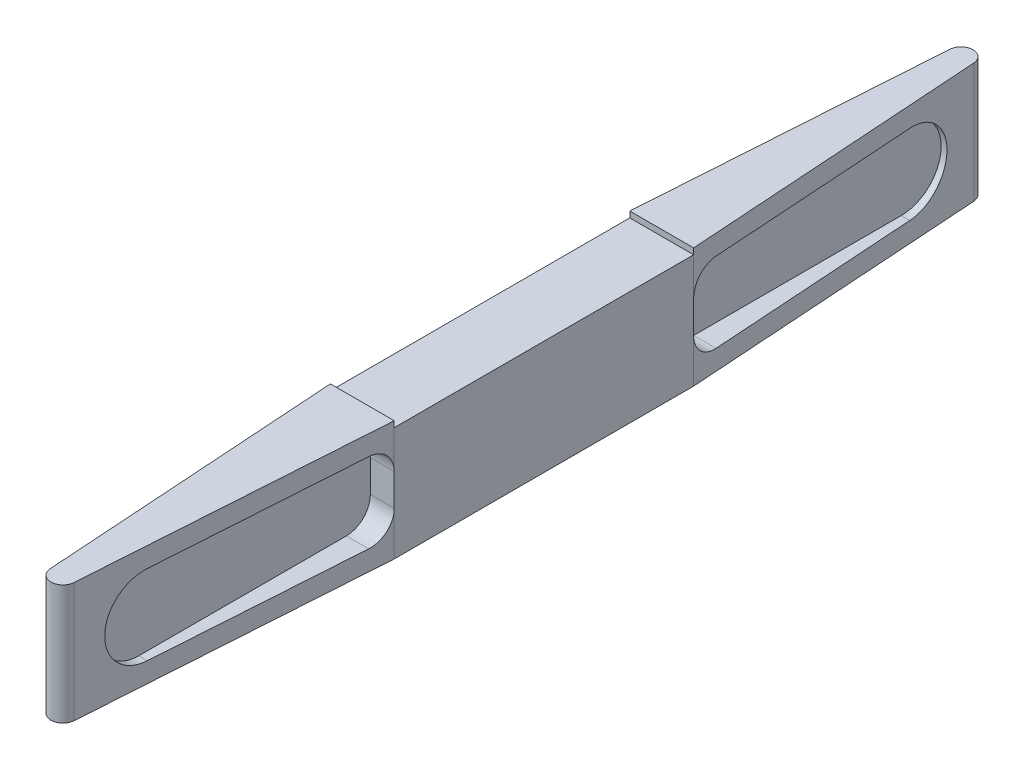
ISO-10303-21;
HEADER;
FILE_DESCRIPTION(('STEP AP214'),'2;1');
FILE_NAME('part.step','',(''),(''),'','','');
FILE_SCHEMA(('AUTOMOTIVE_DESIGN { 1 0 10303 214 1 1 1 1 }'));
ENDSEC;
DATA;
#1=APPLICATION_CONTEXT('core data for automotive mechanical design processes');
#2=APPLICATION_PROTOCOL_DEFINITION('international standard','automotive_design',2000,#1);
#3=PRODUCT_CONTEXT('',#1,'mechanical');
#4=PRODUCT('Part','Part','',(#3));
#5=PRODUCT_RELATED_PRODUCT_CATEGORY('part','',(#4));
#6=PRODUCT_DEFINITION_FORMATION('','',#4);
#7=PRODUCT_DEFINITION_CONTEXT('part definition',#1,'design');
#8=PRODUCT_DEFINITION('design','',#6,#7);
#9=PRODUCT_DEFINITION_SHAPE('','',#8);
#10=(LENGTH_UNIT() NAMED_UNIT(*) SI_UNIT(.MILLI.,.METRE.));
#11=(NAMED_UNIT(*) PLANE_ANGLE_UNIT() SI_UNIT($,.RADIAN.));
#12=(NAMED_UNIT(*) SI_UNIT($,.STERADIAN.) SOLID_ANGLE_UNIT());
#13=UNCERTAINTY_MEASURE_WITH_UNIT(LENGTH_MEASURE(1.E-05),#10,'distance_accuracy_value','');
#14=(GEOMETRIC_REPRESENTATION_CONTEXT(3) GLOBAL_UNCERTAINTY_ASSIGNED_CONTEXT((#13)) GLOBAL_UNIT_ASSIGNED_CONTEXT((#10,
#11,#12)) REPRESENTATION_CONTEXT('',''));
#15=CARTESIAN_POINT('',(0.,0.,0.));
#16=DIRECTION('',(0.,0.,1.));
#17=DIRECTION('',(1.,0.,0.));
#18=AXIS2_PLACEMENT_3D('',#15,#16,#17);
#19=CARTESIAN_POINT('',(8.,30.,-37.5));
#20=DIRECTION('',(1.,0.,0.));
#21=DIRECTION('',(0.,0.,-1.));
#22=AXIS2_PLACEMENT_3D('',#19,#20,#21);
#23=PLANE('',#22);
#24=DIRECTION('',(0.,-1.,0.));
#25=VECTOR('',#24,1.);
#26=CARTESIAN_POINT('',(8.,30.,-37.5));
#27=LINE('',#26,#25);
#28=CARTESIAN_POINT('',(8.,28.5,-37.5));
#29=VERTEX_POINT('',#28);
#30=CARTESIAN_POINT('',(8.,19.,-37.5));
#31=VERTEX_POINT('',#30);
#32=EDGE_CURVE('E555',#29,#31,#27,.T.);
#33=ORIENTED_EDGE('',*,*,#32,.F.);
#34=DIRECTION('',(0.,0.,1.));
#35=VECTOR('',#34,1.);
#36=CARTESIAN_POINT('',(8.,28.5,-37.5));
#37=LINE('',#36,#35);
#38=CARTESIAN_POINT('',(8.,28.5,37.5));
#39=VERTEX_POINT('',#38);
#40=EDGE_CURVE('E272',#29,#39,#37,.T.);
#41=ORIENTED_EDGE('',*,*,#40,.T.);
#42=DIRECTION('',(0.,-1.,0.));
#43=VECTOR('',#42,1.);
#44=CARTESIAN_POINT('',(8.,30.,37.5));
#45=LINE('',#44,#43);
#46=CARTESIAN_POINT('',(8.,19.,37.5));
#47=VERTEX_POINT('',#46);
#48=EDGE_CURVE('E304',#39,#47,#45,.T.);
#49=ORIENTED_EDGE('',*,*,#48,.T.);
#50=DIRECTION('',(0.,-1.,0.));
#51=VECTOR('',#50,1.);
#52=CARTESIAN_POINT('',(8.,25.,37.5));
#53=LINE('',#52,#51);
#54=CARTESIAN_POINT('',(8.,11.,37.5));
#55=VERTEX_POINT('',#54);
#56=EDGE_CURVE('E497',#47,#55,#53,.T.);
#57=ORIENTED_EDGE('',*,*,#56,.T.);
#58=CARTESIAN_POINT('',(8.,0.,37.5));
#59=VERTEX_POINT('',#58);
#60=EDGE_CURVE('E305',#55,#59,#45,.T.);
#61=ORIENTED_EDGE('',*,*,#60,.T.);
#62=DIRECTION('',(0.,0.,1.));
#63=VECTOR('',#62,1.);
#64=CARTESIAN_POINT('',(8.,0.,-37.5));
#65=LINE('',#64,#63);
#66=CARTESIAN_POINT('',(8.,0.,-37.5));
#67=VERTEX_POINT('',#66);
#68=EDGE_CURVE('E518',#67,#59,#65,.T.);
#69=ORIENTED_EDGE('',*,*,#68,.F.);
#70=CARTESIAN_POINT('',(8.,11.,-37.5));
#71=VERTEX_POINT('',#70);
#72=EDGE_CURVE('E50',#71,#67,#27,.T.);
#73=ORIENTED_EDGE('',*,*,#72,.F.);
#74=DIRECTION('',(0.,-1.,0.));
#75=VECTOR('',#74,1.);
#76=CARTESIAN_POINT('',(8.,25.,-37.5));
#77=LINE('',#76,#75);
#78=EDGE_CURVE('E430',#31,#71,#77,.T.);
#79=ORIENTED_EDGE('',*,*,#78,.F.);
#80=EDGE_LOOP('',(#33,#41,#49,#57,#61,#69,#73,#79));
#81=FACE_BOUND('',#80,.T.);
#82=ADVANCED_FACE('F34',(#81),#23,.T.);
#83=CARTESIAN_POINT('',(-8.,30.,-37.5));
#84=DIRECTION('',(1.,0.,0.));
#85=DIRECTION('',(0.,0.,-1.));
#86=AXIS2_PLACEMENT_3D('',#83,#84,#85);
#87=PLANE('',#86);
#88=DIRECTION('',(0.,0.,-1.));
#89=VECTOR('',#88,1.);
#90=CARTESIAN_POINT('',(-8.,28.5,37.5));
#91=LINE('',#90,#89);
#92=CARTESIAN_POINT('',(-8.,28.5,37.5));
#93=VERTEX_POINT('',#92);
#94=CARTESIAN_POINT('',(-8.00000000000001,28.5,-37.5));
#95=VERTEX_POINT('',#94);
#96=EDGE_CURVE('E269',#93,#95,#91,.T.);
#97=ORIENTED_EDGE('',*,*,#96,.T.);
#98=DIRECTION('',(0.,-1.,0.));
#99=VECTOR('',#98,1.);
#100=CARTESIAN_POINT('',(-8.,30.,-37.5));
#101=LINE('',#100,#99);
#102=CARTESIAN_POINT('',(-8.,19.,-37.5));
#103=VERTEX_POINT('',#102);
#104=EDGE_CURVE('E262',#95,#103,#101,.T.);
#105=ORIENTED_EDGE('',*,*,#104,.T.);
#106=DIRECTION('',(0.,-1.,0.));
#107=VECTOR('',#106,1.);
#108=CARTESIAN_POINT('',(-8.,25.,-37.5));
#109=LINE('',#108,#107);
#110=CARTESIAN_POINT('',(-8.,11.,-37.5));
#111=VERTEX_POINT('',#110);
#112=EDGE_CURVE('E460',#103,#111,#109,.T.);
#113=ORIENTED_EDGE('',*,*,#112,.T.);
#114=CARTESIAN_POINT('',(-8.,0.,-37.5));
#115=VERTEX_POINT('',#114);
#116=EDGE_CURVE('E264',#111,#115,#101,.T.);
#117=ORIENTED_EDGE('',*,*,#116,.T.);
#118=DIRECTION('',(0.,0.,1.));
#119=VECTOR('',#118,1.);
#120=CARTESIAN_POINT('',(-8.,0.,-37.5));
#121=LINE('',#120,#119);
#122=CARTESIAN_POINT('',(-8.,0.,37.5));
#123=VERTEX_POINT('',#122);
#124=EDGE_CURVE('E544',#115,#123,#121,.T.);
#125=ORIENTED_EDGE('',*,*,#124,.T.);
#126=DIRECTION('',(0.,-1.,0.));
#127=VECTOR('',#126,1.);
#128=CARTESIAN_POINT('',(-8.,30.,37.5));
#129=LINE('',#128,#127);
#130=CARTESIAN_POINT('',(-8.,11.,37.5));
#131=VERTEX_POINT('',#130);
#132=EDGE_CURVE('E295',#131,#123,#129,.T.);
#133=ORIENTED_EDGE('',*,*,#132,.F.);
#134=DIRECTION('',(0.,-1.,0.));
#135=VECTOR('',#134,1.);
#136=CARTESIAN_POINT('',(-8.,25.,37.5));
#137=LINE('',#136,#135);
#138=CARTESIAN_POINT('',(-8.,19.,37.5));
#139=VERTEX_POINT('',#138);
#140=EDGE_CURVE('E478',#139,#131,#137,.T.);
#141=ORIENTED_EDGE('',*,*,#140,.F.);
#142=EDGE_CURVE('E281',#93,#139,#129,.T.);
#143=ORIENTED_EDGE('',*,*,#142,.F.);
#144=EDGE_LOOP('',(#97,#105,#113,#117,#125,#133,#141,#143));
#145=FACE_BOUND('',#144,.T.);
#146=ADVANCED_FACE('F277',(#145),#87,.F.);
#147=CARTESIAN_POINT('',(0.,30.,112.5));
#148=DIRECTION('',(0.,1.,0.));
#149=DIRECTION('',(0.,0.,1.));
#150=AXIS2_PLACEMENT_3D('',#147,#148,#149);
#151=PLANE('',#150);
#152=DIRECTION('',(-1.,0.,0.));
#153=VECTOR('',#152,1.);
#154=CARTESIAN_POINT('',(8.,30.,-37.5));
#155=LINE('',#154,#153);
#156=CARTESIAN_POINT('',(8.,30.,-37.5));
#157=VERTEX_POINT('',#156);
#158=CARTESIAN_POINT('',(-8.00000000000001,30.,-37.5));
#159=VERTEX_POINT('',#158);
#160=EDGE_CURVE('E256',#157,#159,#155,.T.);
#161=ORIENTED_EDGE('',*,*,#160,.F.);
#162=DIRECTION('',(-0.0664310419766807,0.,-0.997791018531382));
#163=VECTOR('',#162,1.);
#164=CARTESIAN_POINT('',(8.,30.,-37.5));
#165=LINE('',#164,#163);
#166=CARTESIAN_POINT('',(2.99337305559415,30.,-112.69929312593));
#167=VERTEX_POINT('',#166);
#168=EDGE_CURVE('E532',#157,#167,#165,.T.);
#169=ORIENTED_EDGE('',*,*,#168,.T.);
#170=CARTESIAN_POINT('',(0.,30.,-112.5));
#171=DIRECTION('',(0.,-1.,0.));
#172=DIRECTION('',(0.,0.,-1.));
#173=AXIS2_PLACEMENT_3D('',#170,#171,#172);
#174=CIRCLE('',#173,3.);
#175=CARTESIAN_POINT('',(-2.99337305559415,30.,-112.69929312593));
#176=VERTEX_POINT('',#175);
#177=EDGE_CURVE('E529',#176,#167,#174,.T.);
#178=ORIENTED_EDGE('',*,*,#177,.F.);
#179=DIRECTION('',(0.0664310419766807,0.,-0.997791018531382));
#180=VECTOR('',#179,1.);
#181=CARTESIAN_POINT('',(-8.,30.,-37.5));
#182=LINE('',#181,#180);
#183=EDGE_CURVE('E527',#159,#176,#182,.T.);
#184=ORIENTED_EDGE('',*,*,#183,.F.);
#185=EDGE_LOOP('',(#161,#169,#178,#184));
#186=FACE_BOUND('',#185,.T.);
#187=ADVANCED_FACE('F613',(#186),#151,.T.);
#188=CARTESIAN_POINT('',(8.,30.,-37.5));
#189=DIRECTION('',(-0.997791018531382,0.,0.0664310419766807));
#190=DIRECTION('',(0.0664310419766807,0.,0.997791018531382));
#191=AXIS2_PLACEMENT_3D('',#188,#189,#190);
#192=PLANE('',#191);
#193=DIRECTION('',(0.0664310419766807,0.,0.997791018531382));
#194=VECTOR('',#193,1.);
#195=CARTESIAN_POINT('',(8.,25.,-37.5));
#196=LINE('',#195,#194);
#197=CARTESIAN_POINT('',(4.13846951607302,25.,-95.5));
#198=VERTEX_POINT('',#197);
#199=CARTESIAN_POINT('',(7.60053132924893,25.,-43.5));
#200=VERTEX_POINT('',#199);
#201=EDGE_CURVE('E395',#198,#200,#196,.T.);
#202=ORIENTED_EDGE('',*,*,#201,.F.);
#203=CARTESIAN_POINT('',(4.13846951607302,15.,-95.5));
#204=DIRECTION('',(-0.997791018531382,0.,0.0664310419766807));
#205=DIRECTION('',(0.0664310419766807,0.,0.997791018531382));
#206=AXIS2_PLACEMENT_3D('',#203,#204,#205);
#207=ELLIPSE('',#206,10.0221387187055,10.);
#208=CARTESIAN_POINT('',(4.13846951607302,4.99999999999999,-95.5));
#209=VERTEX_POINT('',#208);
#210=EDGE_CURVE('E391',#198,#209,#207,.T.);
#211=ORIENTED_EDGE('',*,*,#210,.T.);
#212=DIRECTION('',(0.0664310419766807,0.,0.997791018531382));
#213=VECTOR('',#212,1.);
#214=CARTESIAN_POINT('',(8.,5.,-37.5));
#215=LINE('',#214,#213);
#216=CARTESIAN_POINT('',(7.60053132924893,5.,-43.5));
#217=VERTEX_POINT('',#216);
#218=EDGE_CURVE('E388',#209,#217,#215,.T.);
#219=ORIENTED_EDGE('',*,*,#218,.T.);
#220=CARTESIAN_POINT('',(7.60053132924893,11.,-43.5));
#221=DIRECTION('',(-0.997791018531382,0.,0.0664310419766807));
#222=DIRECTION('',(-0.0664310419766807,0.,-0.997791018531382));
#223=AXIS2_PLACEMENT_3D('',#220,#221,#222);
#224=ELLIPSE('',#223,6.01328323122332,6.);
#225=EDGE_CURVE('E43',#217,#71,#224,.T.);
#226=ORIENTED_EDGE('',*,*,#225,.T.);
#227=ORIENTED_EDGE('',*,*,#72,.T.);
#228=DIRECTION('',(-0.0664310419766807,0.,-0.997791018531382));
#229=VECTOR('',#228,1.);
#230=CARTESIAN_POINT('',(8.,0.,-37.5));
#231=LINE('',#230,#229);
#232=CARTESIAN_POINT('',(2.99337305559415,0.,-112.69929312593));
#233=VERTEX_POINT('',#232);
#234=EDGE_CURVE('E523',#67,#233,#231,.T.);
#235=ORIENTED_EDGE('',*,*,#234,.T.);
#236=DIRECTION('',(0.,-1.,0.));
#237=VECTOR('',#236,1.);
#238=CARTESIAN_POINT('',(2.99337305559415,30.,-112.69929312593));
#239=LINE('',#238,#237);
#240=EDGE_CURVE('E556',#167,#233,#239,.T.);
#241=ORIENTED_EDGE('',*,*,#240,.F.);
#242=ORIENTED_EDGE('',*,*,#168,.F.);
#243=EDGE_CURVE('E309',#157,#29,#27,.T.);
#244=ORIENTED_EDGE('',*,*,#243,.T.);
#245=ORIENTED_EDGE('',*,*,#32,.T.);
#246=CARTESIAN_POINT('',(7.60053132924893,19.,-43.5));
#247=DIRECTION('',(-0.997791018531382,0.,0.0664310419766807));
#248=DIRECTION('',(0.0664310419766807,0.,0.997791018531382));
#249=AXIS2_PLACEMENT_3D('',#246,#247,#248);
#250=ELLIPSE('',#249,6.01328323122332,6.);
#251=EDGE_CURVE('E11',#31,#200,#250,.T.);
#252=ORIENTED_EDGE('',*,*,#251,.T.);
#253=EDGE_LOOP('',(#202,#211,#219,#226,#227,#235,#241,#242,#244,#245,#252));
#254=FACE_BOUND('',#253,.T.);
#255=ADVANCED_FACE('F417',(#254),#192,.F.);
#256=CARTESIAN_POINT('',(-8.,30.,-37.5));
#257=DIRECTION('',(-0.997791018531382,0.,-0.0664310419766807));
#258=DIRECTION('',(-0.0664310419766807,0.,0.997791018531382));
#259=AXIS2_PLACEMENT_3D('',#256,#257,#258);
#260=PLANE('',#259);
#261=ORIENTED_EDGE('',*,*,#116,.F.);
#262=CARTESIAN_POINT('',(-7.60053132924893,11.,-43.5));
#263=DIRECTION('',(-0.997791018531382,0.,-0.0664310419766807));
#264=DIRECTION('',(0.0664310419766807,0.,-0.997791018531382));
#265=AXIS2_PLACEMENT_3D('',#262,#263,#264);
#266=ELLIPSE('',#265,6.01328323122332,6.);
#267=CARTESIAN_POINT('',(-7.60053132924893,5.,-43.5));
#268=VERTEX_POINT('',#267);
#269=EDGE_CURVE('E385',#111,#268,#266,.F.);
#270=ORIENTED_EDGE('',*,*,#269,.T.);
#271=DIRECTION('',(0.0664310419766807,0.,-0.997791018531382));
#272=VECTOR('',#271,1.);
#273=CARTESIAN_POINT('',(-8.,5.,-37.5));
#274=LINE('',#273,#272);
#275=CARTESIAN_POINT('',(-4.13846951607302,4.99999999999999,-95.5));
#276=VERTEX_POINT('',#275);
#277=EDGE_CURVE('E368',#268,#276,#274,.T.);
#278=ORIENTED_EDGE('',*,*,#277,.T.);
#279=CARTESIAN_POINT('',(-4.13846951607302,15.,-95.5));
#280=DIRECTION('',(-0.997791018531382,0.,-0.0664310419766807));
#281=DIRECTION('',(-0.0664310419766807,0.,0.997791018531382));
#282=AXIS2_PLACEMENT_3D('',#279,#280,#281);
#283=ELLIPSE('',#282,10.0221387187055,10.);
#284=CARTESIAN_POINT('',(-4.13846951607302,25.,-95.5));
#285=VERTEX_POINT('',#284);
#286=EDGE_CURVE('E365',#276,#285,#283,.F.);
#287=ORIENTED_EDGE('',*,*,#286,.T.);
#288=DIRECTION('',(0.0664310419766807,0.,-0.997791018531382));
#289=VECTOR('',#288,1.);
#290=CARTESIAN_POINT('',(-8.,25.,-37.5));
#291=LINE('',#290,#289);
#292=CARTESIAN_POINT('',(-7.60053132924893,25.,-43.5));
#293=VERTEX_POINT('',#292);
#294=EDGE_CURVE('E362',#293,#285,#291,.T.);
#295=ORIENTED_EDGE('',*,*,#294,.F.);
#296=CARTESIAN_POINT('',(-7.60053132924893,19.,-43.5));
#297=DIRECTION('',(-0.997791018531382,0.,-0.0664310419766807));
#298=DIRECTION('',(-0.0664310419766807,0.,0.997791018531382));
#299=AXIS2_PLACEMENT_3D('',#296,#297,#298);
#300=ELLIPSE('',#299,6.01328323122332,6.);
#301=EDGE_CURVE('E288',#293,#103,#300,.F.);
#302=ORIENTED_EDGE('',*,*,#301,.T.);
#303=ORIENTED_EDGE('',*,*,#104,.F.);
#304=EDGE_CURVE('E250',#159,#95,#101,.T.);
#305=ORIENTED_EDGE('',*,*,#304,.F.);
#306=ORIENTED_EDGE('',*,*,#183,.T.);
#307=DIRECTION('',(0.,-1.,0.));
#308=VECTOR('',#307,1.);
#309=CARTESIAN_POINT('',(-2.99337305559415,30.,-112.69929312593));
#310=LINE('',#309,#308);
#311=CARTESIAN_POINT('',(-2.99337305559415,0.,-112.69929312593));
#312=VERTEX_POINT('',#311);
#313=EDGE_CURVE('E261',#176,#312,#310,.T.);
#314=ORIENTED_EDGE('',*,*,#313,.T.);
#315=DIRECTION('',(0.0664310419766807,0.,-0.997791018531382));
#316=VECTOR('',#315,1.);
#317=CARTESIAN_POINT('',(-8.,0.,-37.5));
#318=LINE('',#317,#316);
#319=EDGE_CURVE('E547',#115,#312,#318,.T.);
#320=ORIENTED_EDGE('',*,*,#319,.F.);
#321=EDGE_LOOP('',(#261,#270,#278,#287,#295,#302,#303,#305,#306,#314,#320));
#322=FACE_BOUND('',#321,.T.);
#323=ADVANCED_FACE('F286',(#322),#260,.T.);
#324=CARTESIAN_POINT('',(-8.,30.,37.5));
#325=DIRECTION('',(0.997791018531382,0.,-0.0664310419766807));
#326=DIRECTION('',(-0.0664310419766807,0.,-0.997791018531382));
#327=AXIS2_PLACEMENT_3D('',#324,#325,#326);
#328=PLANE('',#327);
#329=DIRECTION('',(-0.0664310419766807,0.,-0.997791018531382));
#330=VECTOR('',#329,1.);
#331=CARTESIAN_POINT('',(-8.,25.,37.5));
#332=LINE('',#331,#330);
#333=CARTESIAN_POINT('',(-4.13846951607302,25.,95.5));
#334=VERTEX_POINT('',#333);
#335=CARTESIAN_POINT('',(-7.60053132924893,25.,43.5));
#336=VERTEX_POINT('',#335);
#337=EDGE_CURVE('E340',#334,#336,#332,.T.);
#338=ORIENTED_EDGE('',*,*,#337,.F.);
#339=CARTESIAN_POINT('',(-4.13846951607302,15.,95.5));
#340=DIRECTION('',(0.997791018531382,0.,-0.0664310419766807));
#341=DIRECTION('',(-0.0664310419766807,0.,-0.997791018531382));
#342=AXIS2_PLACEMENT_3D('',#339,#340,#341);
#343=ELLIPSE('',#342,10.0221387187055,10.);
#344=CARTESIAN_POINT('',(-4.13846951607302,4.99999999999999,95.5));
#345=VERTEX_POINT('',#344);
#346=EDGE_CURVE('E337',#334,#345,#343,.T.);
#347=ORIENTED_EDGE('',*,*,#346,.T.);
#348=DIRECTION('',(-0.0664310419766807,0.,-0.997791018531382));
#349=VECTOR('',#348,1.);
#350=CARTESIAN_POINT('',(-8.,5.,37.5));
#351=LINE('',#350,#349);
#352=CARTESIAN_POINT('',(-7.60053132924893,5.,43.5));
#353=VERTEX_POINT('',#352);
#354=EDGE_CURVE('E334',#345,#353,#351,.T.);
#355=ORIENTED_EDGE('',*,*,#354,.T.);
#356=CARTESIAN_POINT('',(-7.60053132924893,11.,43.5));
#357=DIRECTION('',(0.997791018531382,0.,-0.0664310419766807));
#358=DIRECTION('',(0.0664310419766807,0.,0.997791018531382));
#359=AXIS2_PLACEMENT_3D('',#356,#357,#358);
#360=ELLIPSE('',#359,6.01328323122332,6.);
#361=EDGE_CURVE('E357',#353,#131,#360,.T.);
#362=ORIENTED_EDGE('',*,*,#361,.T.);
#363=ORIENTED_EDGE('',*,*,#132,.T.);
#364=DIRECTION('',(0.0664310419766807,0.,0.997791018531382));
#365=VECTOR('',#364,1.);
#366=CARTESIAN_POINT('',(-8.,0.,37.5));
#367=LINE('',#366,#365);
#368=CARTESIAN_POINT('',(-2.99337305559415,0.,112.69929312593));
#369=VERTEX_POINT('',#368);
#370=EDGE_CURVE('E542',#123,#369,#367,.T.);
#371=ORIENTED_EDGE('',*,*,#370,.T.);
#372=DIRECTION('',(0.,-1.,0.));
#373=VECTOR('',#372,1.);
#374=CARTESIAN_POINT('',(-2.99337305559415,30.,112.69929312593));
#375=LINE('',#374,#373);
#376=CARTESIAN_POINT('',(-2.99337305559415,30.,112.69929312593));
#377=VERTEX_POINT('',#376);
#378=EDGE_CURVE('E296',#377,#369,#375,.T.);
#379=ORIENTED_EDGE('',*,*,#378,.F.);
#380=DIRECTION('',(0.0664310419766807,0.,0.997791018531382));
#381=VECTOR('',#380,1.);
#382=CARTESIAN_POINT('',(-8.,30.,37.5));
#383=LINE('',#382,#381);
#384=CARTESIAN_POINT('',(-8.,30.,37.5));
#385=VERTEX_POINT('',#384);
#386=EDGE_CURVE('E525',#385,#377,#383,.T.);
#387=ORIENTED_EDGE('',*,*,#386,.F.);
#388=EDGE_CURVE('E290',#385,#93,#129,.T.);
#389=ORIENTED_EDGE('',*,*,#388,.T.);
#390=ORIENTED_EDGE('',*,*,#142,.T.);
#391=CARTESIAN_POINT('',(-7.60053132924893,19.,43.5));
#392=DIRECTION('',(0.997791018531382,0.,-0.0664310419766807));
#393=DIRECTION('',(-0.0664310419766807,0.,-0.997791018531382));
#394=AXIS2_PLACEMENT_3D('',#391,#392,#393);
#395=ELLIPSE('',#394,6.01328323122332,6.);
#396=EDGE_CURVE('E360',#139,#336,#395,.T.);
#397=ORIENTED_EDGE('',*,*,#396,.T.);
#398=EDGE_LOOP('',(#338,#347,#355,#362,#363,#371,#379,#387,#389,#390,#397));
#399=FACE_BOUND('',#398,.T.);
#400=ADVANCED_FACE('F757',(#399),#328,.F.);
#401=CARTESIAN_POINT('',(8.,30.,37.5));
#402=DIRECTION('',(0.997791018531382,0.,0.0664310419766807));
#403=DIRECTION('',(0.0664310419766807,0.,-0.997791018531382));
#404=AXIS2_PLACEMENT_3D('',#401,#402,#403);
#405=PLANE('',#404);
#406=ORIENTED_EDGE('',*,*,#60,.F.);
#407=CARTESIAN_POINT('',(7.60053132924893,11.,43.5));
#408=DIRECTION('',(0.997791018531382,0.,0.0664310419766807));
#409=DIRECTION('',(-0.0664310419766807,0.,0.997791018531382));
#410=AXIS2_PLACEMENT_3D('',#407,#408,#409);
#411=ELLIPSE('',#410,6.01328323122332,6.);
#412=CARTESIAN_POINT('',(7.60053132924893,5.,43.5));
#413=VERTEX_POINT('',#412);
#414=EDGE_CURVE('E329',#55,#413,#411,.F.);
#415=ORIENTED_EDGE('',*,*,#414,.T.);
#416=DIRECTION('',(-0.0664310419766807,0.,0.997791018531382));
#417=VECTOR('',#416,1.);
#418=CARTESIAN_POINT('',(8.,5.,37.5));
#419=LINE('',#418,#417);
#420=CARTESIAN_POINT('',(4.13846951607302,4.99999999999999,95.5));
#421=VERTEX_POINT('',#420);
#422=EDGE_CURVE('E313',#413,#421,#419,.T.);
#423=ORIENTED_EDGE('',*,*,#422,.T.);
#424=CARTESIAN_POINT('',(4.13846951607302,15.,95.5));
#425=DIRECTION('',(0.997791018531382,0.,0.0664310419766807));
#426=DIRECTION('',(0.0664310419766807,0.,-0.997791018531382));
#427=AXIS2_PLACEMENT_3D('',#424,#425,#426);
#428=ELLIPSE('',#427,10.0221387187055,10.);
#429=CARTESIAN_POINT('',(4.13846951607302,25.,95.5));
#430=VERTEX_POINT('',#429);
#431=EDGE_CURVE('E308',#421,#430,#428,.F.);
#432=ORIENTED_EDGE('',*,*,#431,.T.);
#433=DIRECTION('',(-0.0664310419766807,0.,0.997791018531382));
#434=VECTOR('',#433,1.);
#435=CARTESIAN_POINT('',(8.,25.,37.5));
#436=LINE('',#435,#434);
#437=CARTESIAN_POINT('',(7.60053132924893,25.,43.5));
#438=VERTEX_POINT('',#437);
#439=EDGE_CURVE('E306',#438,#430,#436,.T.);
#440=ORIENTED_EDGE('',*,*,#439,.F.);
#441=CARTESIAN_POINT('',(7.60053132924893,19.,43.5));
#442=DIRECTION('',(0.997791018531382,0.,0.0664310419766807));
#443=DIRECTION('',(0.0664310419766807,0.,-0.997791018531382));
#444=AXIS2_PLACEMENT_3D('',#441,#442,#443);
#445=ELLIPSE('',#444,6.01328323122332,6.);
#446=EDGE_CURVE('E331',#438,#47,#445,.F.);
#447=ORIENTED_EDGE('',*,*,#446,.T.);
#448=ORIENTED_EDGE('',*,*,#48,.F.);
#449=CARTESIAN_POINT('',(8.,30.,37.5));
#450=VERTEX_POINT('',#449);
#451=EDGE_CURVE('E302',#450,#39,#45,.T.);
#452=ORIENTED_EDGE('',*,*,#451,.F.);
#453=DIRECTION('',(-0.0664310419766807,0.,0.997791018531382));
#454=VECTOR('',#453,1.);
#455=CARTESIAN_POINT('',(8.,30.,37.5));
#456=LINE('',#455,#454);
#457=CARTESIAN_POINT('',(2.99337305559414,30.,112.69929312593));
#458=VERTEX_POINT('',#457);
#459=EDGE_CURVE('E519',#450,#458,#456,.T.);
#460=ORIENTED_EDGE('',*,*,#459,.T.);
#461=DIRECTION('',(0.,-1.,0.));
#462=VECTOR('',#461,1.);
#463=CARTESIAN_POINT('',(2.99337305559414,30.,112.69929312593));
#464=LINE('',#463,#462);
#465=CARTESIAN_POINT('',(2.99337305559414,0.,112.69929312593));
#466=VERTEX_POINT('',#465);
#467=EDGE_CURVE('E299',#458,#466,#464,.T.);
#468=ORIENTED_EDGE('',*,*,#467,.T.);
#469=DIRECTION('',(-0.0664310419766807,0.,0.997791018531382));
#470=VECTOR('',#469,1.);
#471=CARTESIAN_POINT('',(8.,0.,37.5));
#472=LINE('',#471,#470);
#473=EDGE_CURVE('E536',#59,#466,#472,.T.);
#474=ORIENTED_EDGE('',*,*,#473,.F.);
#475=EDGE_LOOP('',(#406,#415,#423,#432,#440,#447,#448,#452,#460,#468,#474));
#476=FACE_BOUND('',#475,.T.);
#477=ADVANCED_FACE('F617',(#476),#405,.T.);
#478=CARTESIAN_POINT('',(0.,30.,-112.5));
#479=DIRECTION('',(0.,-1.,0.));
#480=DIRECTION('',(0.,0.,-1.));
#481=AXIS2_PLACEMENT_3D('',#478,#479,#480);
#482=CYLINDRICAL_SURFACE('',#481,3.);
#483=CARTESIAN_POINT('',(0.,0.,-112.5));
#484=DIRECTION('',(0.,-1.,0.));
#485=DIRECTION('',(0.,0.,-1.));
#486=AXIS2_PLACEMENT_3D('',#483,#484,#485);
#487=CIRCLE('',#486,3.);
#488=EDGE_CURVE('E550',#312,#233,#487,.T.);
#489=ORIENTED_EDGE('',*,*,#488,.F.);
#490=ORIENTED_EDGE('',*,*,#313,.F.);
#491=ORIENTED_EDGE('',*,*,#177,.T.);
#492=ORIENTED_EDGE('',*,*,#240,.T.);
#493=EDGE_LOOP('',(#489,#490,#491,#492));
#494=FACE_BOUND('',#493,.T.);
#495=ADVANCED_FACE('F565',(#494),#482,.T.);
#496=CARTESIAN_POINT('',(0.,30.,112.5));
#497=DIRECTION('',(0.,-1.,0.));
#498=DIRECTION('',(0.,0.,-1.));
#499=AXIS2_PLACEMENT_3D('',#496,#497,#498);
#500=CYLINDRICAL_SURFACE('',#499,3.);
#501=CARTESIAN_POINT('',(0.,0.,112.5));
#502=DIRECTION('',(0.,1.,0.));
#503=DIRECTION('',(0.,0.,1.));
#504=AXIS2_PLACEMENT_3D('',#501,#502,#503);
#505=CIRCLE('',#504,3.);
#506=EDGE_CURVE('E539',#369,#466,#505,.T.);
#507=ORIENTED_EDGE('',*,*,#506,.T.);
#508=ORIENTED_EDGE('',*,*,#467,.F.);
#509=CARTESIAN_POINT('',(0.,30.,112.5));
#510=DIRECTION('',(0.,1.,0.));
#511=DIRECTION('',(0.,0.,1.));
#512=AXIS2_PLACEMENT_3D('',#509,#510,#511);
#513=CIRCLE('',#512,3.);
#514=EDGE_CURVE('E522',#377,#458,#513,.T.);
#515=ORIENTED_EDGE('',*,*,#514,.F.);
#516=ORIENTED_EDGE('',*,*,#378,.T.);
#517=EDGE_LOOP('',(#507,#508,#515,#516));
#518=FACE_BOUND('',#517,.T.);
#519=ADVANCED_FACE('F790',(#518),#500,.T.);
#520=DIRECTION('',(1.,0.,0.));
#521=VECTOR('',#520,1.);
#522=CARTESIAN_POINT('',(-8.,30.,37.5));
#523=LINE('',#522,#521);
#524=EDGE_CURVE('E283',#385,#450,#523,.T.);
#525=ORIENTED_EDGE('',*,*,#524,.F.);
#526=ORIENTED_EDGE('',*,*,#386,.T.);
#527=ORIENTED_EDGE('',*,*,#514,.T.);
#528=ORIENTED_EDGE('',*,*,#459,.F.);
#529=EDGE_LOOP('',(#525,#526,#527,#528));
#530=FACE_BOUND('',#529,.T.);
#531=ADVANCED_FACE('F740',(#530),#151,.T.);
#532=CARTESIAN_POINT('',(0.,0.,112.5));
#533=DIRECTION('',(0.,1.,0.));
#534=DIRECTION('',(0.,0.,1.));
#535=AXIS2_PLACEMENT_3D('',#532,#533,#534);
#536=PLANE('',#535);
#537=ORIENTED_EDGE('',*,*,#68,.T.);
#538=ORIENTED_EDGE('',*,*,#473,.T.);
#539=ORIENTED_EDGE('',*,*,#506,.F.);
#540=ORIENTED_EDGE('',*,*,#370,.F.);
#541=ORIENTED_EDGE('',*,*,#124,.F.);
#542=ORIENTED_EDGE('',*,*,#319,.T.);
#543=ORIENTED_EDGE('',*,*,#488,.T.);
#544=ORIENTED_EDGE('',*,*,#234,.F.);
#545=EDGE_LOOP('',(#537,#538,#539,#540,#541,#542,#543,#544));
#546=FACE_BOUND('',#545,.T.);
#547=ADVANCED_FACE('F568',(#546),#536,.F.);
#548=CARTESIAN_POINT('',(2.,25.,37.5));
#549=DIRECTION('',(0.,0.,1.));
#550=DIRECTION('',(1.,0.,0.));
#551=AXIS2_PLACEMENT_3D('',#548,#549,#550);
#552=PLANE('',#551);
#553=DIRECTION('',(0.,-1.,0.));
#554=VECTOR('',#553,1.);
#555=CARTESIAN_POINT('',(2.,25.,37.5));
#556=LINE('',#555,#554);
#557=CARTESIAN_POINT('',(2.,19.,37.5));
#558=VERTEX_POINT('',#557);
#559=CARTESIAN_POINT('',(2.,11.,37.5));
#560=VERTEX_POINT('',#559);
#561=EDGE_CURVE('E498',#558,#560,#556,.T.);
#562=ORIENTED_EDGE('',*,*,#561,.T.);
#563=DIRECTION('',(1.,0.,0.));
#564=VECTOR('',#563,1.);
#565=CARTESIAN_POINT('',(8.,11.,37.5));
#566=LINE('',#565,#564);
#567=EDGE_CURVE('E317',#560,#55,#566,.T.);
#568=ORIENTED_EDGE('',*,*,#567,.T.);
#569=ORIENTED_EDGE('',*,*,#56,.F.);
#570=DIRECTION('',(1.,0.,0.));
#571=VECTOR('',#570,1.);
#572=CARTESIAN_POINT('',(2.,19.,37.5));
#573=LINE('',#572,#571);
#574=EDGE_CURVE('E315',#47,#558,#573,.F.);
#575=ORIENTED_EDGE('',*,*,#574,.T.);
#576=EDGE_LOOP('',(#562,#568,#569,#575));
#577=FACE_BOUND('',#576,.T.);
#578=ADVANCED_FACE('F832',(#577),#552,.T.);
#579=CARTESIAN_POINT('',(2.,5.,37.5));
#580=DIRECTION('',(0.,1.,0.));
#581=DIRECTION('',(0.,0.,1.));
#582=AXIS2_PLACEMENT_3D('',#579,#580,#581);
#583=PLANE('',#582);
#584=ORIENTED_EDGE('',*,*,#422,.F.);
#585=DIRECTION('',(1.,0.,0.));
#586=VECTOR('',#585,1.);
#587=CARTESIAN_POINT('',(2.,5.,43.5));
#588=LINE('',#587,#586);
#589=CARTESIAN_POINT('',(2.,5.,43.5));
#590=VERTEX_POINT('',#589);
#591=EDGE_CURVE('E320',#413,#590,#588,.F.);
#592=ORIENTED_EDGE('',*,*,#591,.T.);
#593=DIRECTION('',(0.,0.,1.));
#594=VECTOR('',#593,1.);
#595=CARTESIAN_POINT('',(2.,5.,37.5));
#596=LINE('',#595,#594);
#597=CARTESIAN_POINT('',(2.,4.99999999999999,95.5));
#598=VERTEX_POINT('',#597);
#599=EDGE_CURVE('E502',#590,#598,#596,.T.);
#600=ORIENTED_EDGE('',*,*,#599,.T.);
#601=DIRECTION('',(1.,0.,0.));
#602=VECTOR('',#601,1.);
#603=CARTESIAN_POINT('',(2.,4.99999999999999,95.5));
#604=LINE('',#603,#602);
#605=EDGE_CURVE('E515',#598,#421,#604,.T.);
#606=ORIENTED_EDGE('',*,*,#605,.T.);
#607=EDGE_LOOP('',(#584,#592,#600,#606));
#608=FACE_BOUND('',#607,.T.);
#609=ADVANCED_FACE('F853',(#608),#583,.T.);
#610=CARTESIAN_POINT('',(2.,15.,95.5));
#611=DIRECTION('',(1.,0.,0.));
#612=DIRECTION('',(0.,0.,-1.));
#613=AXIS2_PLACEMENT_3D('',#610,#611,#612);
#614=CYLINDRICAL_SURFACE('',#613,10.);
#615=ORIENTED_EDGE('',*,*,#605,.F.);
#616=CARTESIAN_POINT('',(2.,15.,95.5));
#617=DIRECTION('',(-1.,0.,0.));
#618=DIRECTION('',(0.,0.,1.));
#619=AXIS2_PLACEMENT_3D('',#616,#617,#618);
#620=CIRCLE('',#619,10.);
#621=CARTESIAN_POINT('',(2.,25.,95.5));
#622=VERTEX_POINT('',#621);
#623=EDGE_CURVE('E504',#598,#622,#620,.T.);
#624=ORIENTED_EDGE('',*,*,#623,.T.);
#625=DIRECTION('',(1.,0.,0.));
#626=VECTOR('',#625,1.);
#627=CARTESIAN_POINT('',(2.,25.,95.5));
#628=LINE('',#627,#626);
#629=EDGE_CURVE('E510',#622,#430,#628,.T.);
#630=ORIENTED_EDGE('',*,*,#629,.T.);
#631=ORIENTED_EDGE('',*,*,#431,.F.);
#632=EDGE_LOOP('',(#615,#624,#630,#631));
#633=FACE_BOUND('',#632,.T.);
#634=ADVANCED_FACE('F849',(#633),#614,.F.);
#635=CARTESIAN_POINT('',(2.,25.,37.5));
#636=DIRECTION('',(0.,1.,0.));
#637=DIRECTION('',(0.,0.,1.));
#638=AXIS2_PLACEMENT_3D('',#635,#636,#637);
#639=PLANE('',#638);
#640=DIRECTION('',(0.,0.,1.));
#641=VECTOR('',#640,1.);
#642=CARTESIAN_POINT('',(2.,25.,37.5));
#643=LINE('',#642,#641);
#644=CARTESIAN_POINT('',(2.,25.,43.5));
#645=VERTEX_POINT('',#644);
#646=EDGE_CURVE('E508',#645,#622,#643,.T.);
#647=ORIENTED_EDGE('',*,*,#646,.F.);
#648=DIRECTION('',(1.,0.,0.));
#649=VECTOR('',#648,1.);
#650=CARTESIAN_POINT('',(2.,25.,43.5));
#651=LINE('',#650,#649);
#652=EDGE_CURVE('E326',#645,#438,#651,.T.);
#653=ORIENTED_EDGE('',*,*,#652,.T.);
#654=ORIENTED_EDGE('',*,*,#439,.T.);
#655=ORIENTED_EDGE('',*,*,#629,.F.);
#656=EDGE_LOOP('',(#647,#653,#654,#655));
#657=FACE_BOUND('',#656,.T.);
#658=ADVANCED_FACE('F845',(#657),#639,.F.);
#659=CARTESIAN_POINT('',(2.,15.,95.5));
#660=DIRECTION('',(-1.,0.,0.));
#661=DIRECTION('',(0.,0.,1.));
#662=AXIS2_PLACEMENT_3D('',#659,#660,#661);
#663=PLANE('',#662);
#664=ORIENTED_EDGE('',*,*,#599,.F.);
#665=CARTESIAN_POINT('',(2.,11.,43.5));
#666=DIRECTION('',(-1.,0.,0.));
#667=DIRECTION('',(0.,0.,1.));
#668=AXIS2_PLACEMENT_3D('',#665,#666,#667);
#669=CIRCLE('',#668,6.);
#670=EDGE_CURVE('E324',#590,#560,#669,.F.);
#671=ORIENTED_EDGE('',*,*,#670,.T.);
#672=ORIENTED_EDGE('',*,*,#561,.F.);
#673=CARTESIAN_POINT('',(2.,19.,43.5));
#674=DIRECTION('',(-1.,0.,0.));
#675=DIRECTION('',(0.,0.,1.));
#676=AXIS2_PLACEMENT_3D('',#673,#674,#675);
#677=CIRCLE('',#676,6.);
#678=EDGE_CURVE('E322',#558,#645,#677,.F.);
#679=ORIENTED_EDGE('',*,*,#678,.T.);
#680=ORIENTED_EDGE('',*,*,#646,.T.);
#681=ORIENTED_EDGE('',*,*,#623,.F.);
#682=EDGE_LOOP('',(#664,#671,#672,#679,#680,#681));
#683=FACE_BOUND('',#682,.T.);
#684=ADVANCED_FACE('F623',(#683),#663,.F.);
#685=CARTESIAN_POINT('',(2.,11.,43.5));
#686=DIRECTION('',(-1.,0.,0.));
#687=DIRECTION('',(0.,0.,1.));
#688=AXIS2_PLACEMENT_3D('',#685,#686,#687);
#689=CYLINDRICAL_SURFACE('',#688,6.);
#690=ORIENTED_EDGE('',*,*,#670,.F.);
#691=ORIENTED_EDGE('',*,*,#591,.F.);
#692=ORIENTED_EDGE('',*,*,#414,.F.);
#693=ORIENTED_EDGE('',*,*,#567,.F.);
#694=EDGE_LOOP('',(#690,#691,#692,#693));
#695=FACE_BOUND('',#694,.T.);
#696=ADVANCED_FACE('F619',(#695),#689,.F.);
#697=CARTESIAN_POINT('',(2.,19.,43.5));
#698=DIRECTION('',(1.,0.,0.));
#699=DIRECTION('',(0.,0.,-1.));
#700=AXIS2_PLACEMENT_3D('',#697,#698,#699);
#701=CYLINDRICAL_SURFACE('',#700,6.);
#702=ORIENTED_EDGE('',*,*,#678,.F.);
#703=ORIENTED_EDGE('',*,*,#574,.F.);
#704=ORIENTED_EDGE('',*,*,#446,.F.);
#705=ORIENTED_EDGE('',*,*,#652,.F.);
#706=EDGE_LOOP('',(#702,#703,#704,#705));
#707=FACE_BOUND('',#706,.T.);
#708=ADVANCED_FACE('F622',(#707),#701,.F.);
#709=CARTESIAN_POINT('',(-2.,25.,37.5));
#710=DIRECTION('',(0.,-1.,0.));
#711=DIRECTION('',(0.,0.,-1.));
#712=AXIS2_PLACEMENT_3D('',#709,#710,#711);
#713=PLANE('',#712);
#714=ORIENTED_EDGE('',*,*,#337,.T.);
#715=DIRECTION('',(-1.,0.,0.));
#716=VECTOR('',#715,1.);
#717=CARTESIAN_POINT('',(-2.,25.,43.5));
#718=LINE('',#717,#716);
#719=CARTESIAN_POINT('',(-2.,25.,43.5));
#720=VERTEX_POINT('',#719);
#721=EDGE_CURVE('E355',#336,#720,#718,.F.);
#722=ORIENTED_EDGE('',*,*,#721,.T.);
#723=DIRECTION('',(0.,0.,1.));
#724=VECTOR('',#723,1.);
#725=CARTESIAN_POINT('',(-2.,25.,37.5));
#726=LINE('',#725,#724);
#727=CARTESIAN_POINT('',(-2.,25.,95.5));
#728=VERTEX_POINT('',#727);
#729=EDGE_CURVE('E482',#720,#728,#726,.T.);
#730=ORIENTED_EDGE('',*,*,#729,.T.);
#731=DIRECTION('',(-1.,0.,0.));
#732=VECTOR('',#731,1.);
#733=CARTESIAN_POINT('',(-2.,25.,95.5));
#734=LINE('',#733,#732);
#735=EDGE_CURVE('E494',#728,#334,#734,.T.);
#736=ORIENTED_EDGE('',*,*,#735,.T.);
#737=EDGE_LOOP('',(#714,#722,#730,#736));
#738=FACE_BOUND('',#737,.T.);
#739=ADVANCED_FACE('F627',(#738),#713,.T.);
#740=CARTESIAN_POINT('',(-2.,15.,95.5));
#741=DIRECTION('',(-1.,0.,0.));
#742=DIRECTION('',(0.,0.,1.));
#743=AXIS2_PLACEMENT_3D('',#740,#741,#742);
#744=CYLINDRICAL_SURFACE('',#743,10.);
#745=ORIENTED_EDGE('',*,*,#735,.F.);
#746=CARTESIAN_POINT('',(-2.,15.,95.5));
#747=DIRECTION('',(-1.,0.,0.));
#748=DIRECTION('',(0.,0.,1.));
#749=AXIS2_PLACEMENT_3D('',#746,#747,#748);
#750=CIRCLE('',#749,10.);
#751=CARTESIAN_POINT('',(-2.,4.99999999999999,95.5));
#752=VERTEX_POINT('',#751);
#753=EDGE_CURVE('E484',#752,#728,#750,.T.);
#754=ORIENTED_EDGE('',*,*,#753,.F.);
#755=DIRECTION('',(-1.,0.,0.));
#756=VECTOR('',#755,1.);
#757=CARTESIAN_POINT('',(-2.,4.99999999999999,95.5));
#758=LINE('',#757,#756);
#759=EDGE_CURVE('E489',#752,#345,#758,.T.);
#760=ORIENTED_EDGE('',*,*,#759,.T.);
#761=ORIENTED_EDGE('',*,*,#346,.F.);
#762=EDGE_LOOP('',(#745,#754,#760,#761));
#763=FACE_BOUND('',#762,.T.);
#764=ADVANCED_FACE('F919',(#763),#744,.F.);
#765=CARTESIAN_POINT('',(-2.,5.,37.5));
#766=DIRECTION('',(0.,-1.,0.));
#767=DIRECTION('',(0.,0.,-1.));
#768=AXIS2_PLACEMENT_3D('',#765,#766,#767);
#769=PLANE('',#768);
#770=DIRECTION('',(0.,0.,1.));
#771=VECTOR('',#770,1.);
#772=CARTESIAN_POINT('',(-2.,5.,37.5));
#773=LINE('',#772,#771);
#774=CARTESIAN_POINT('',(-2.,5.,43.5));
#775=VERTEX_POINT('',#774);
#776=EDGE_CURVE('E487',#775,#752,#773,.T.);
#777=ORIENTED_EDGE('',*,*,#776,.F.);
#778=DIRECTION('',(-1.,0.,0.));
#779=VECTOR('',#778,1.);
#780=CARTESIAN_POINT('',(-8.,5.,43.5));
#781=LINE('',#780,#779);
#782=EDGE_CURVE('E343',#775,#353,#781,.T.);
#783=ORIENTED_EDGE('',*,*,#782,.T.);
#784=ORIENTED_EDGE('',*,*,#354,.F.);
#785=ORIENTED_EDGE('',*,*,#759,.F.);
#786=EDGE_LOOP('',(#777,#783,#784,#785));
#787=FACE_BOUND('',#786,.T.);
#788=ADVANCED_FACE('F929',(#787),#769,.F.);
#789=CARTESIAN_POINT('',(-2.,25.,37.5));
#790=DIRECTION('',(0.,0.,-1.));
#791=DIRECTION('',(-1.,0.,0.));
#792=AXIS2_PLACEMENT_3D('',#789,#790,#791);
#793=PLANE('',#792);
#794=ORIENTED_EDGE('',*,*,#140,.T.);
#795=DIRECTION('',(-1.,0.,0.));
#796=VECTOR('',#795,1.);
#797=CARTESIAN_POINT('',(-2.,11.,37.5));
#798=LINE('',#797,#796);
#799=CARTESIAN_POINT('',(-2.,11.,37.5));
#800=VERTEX_POINT('',#799);
#801=EDGE_CURVE('E349',#131,#800,#798,.F.);
#802=ORIENTED_EDGE('',*,*,#801,.T.);
#803=DIRECTION('',(0.,-1.,0.));
#804=VECTOR('',#803,1.);
#805=CARTESIAN_POINT('',(-2.,25.,37.5));
#806=LINE('',#805,#804);
#807=CARTESIAN_POINT('',(-2.,19.,37.5));
#808=VERTEX_POINT('',#807);
#809=EDGE_CURVE('E479',#808,#800,#806,.T.);
#810=ORIENTED_EDGE('',*,*,#809,.F.);
#811=DIRECTION('',(-1.,0.,0.));
#812=VECTOR('',#811,1.);
#813=CARTESIAN_POINT('',(-2.,19.,37.5));
#814=LINE('',#813,#812);
#815=EDGE_CURVE('E346',#808,#139,#814,.T.);
#816=ORIENTED_EDGE('',*,*,#815,.T.);
#817=EDGE_LOOP('',(#794,#802,#810,#816));
#818=FACE_BOUND('',#817,.T.);
#819=ADVANCED_FACE('F939',(#818),#793,.F.);
#820=CARTESIAN_POINT('',(-2.,15.,95.5));
#821=DIRECTION('',(1.,0.,0.));
#822=DIRECTION('',(0.,0.,1.));
#823=AXIS2_PLACEMENT_3D('',#820,#821,#822);
#824=PLANE('',#823);
#825=ORIENTED_EDGE('',*,*,#809,.T.);
#826=CARTESIAN_POINT('',(-2.,11.,43.5));
#827=DIRECTION('',(1.,0.,0.));
#828=DIRECTION('',(0.,0.,-1.));
#829=AXIS2_PLACEMENT_3D('',#826,#827,#828);
#830=CIRCLE('',#829,6.);
#831=EDGE_CURVE('E353',#800,#775,#830,.F.);
#832=ORIENTED_EDGE('',*,*,#831,.T.);
#833=ORIENTED_EDGE('',*,*,#776,.T.);
#834=ORIENTED_EDGE('',*,*,#753,.T.);
#835=ORIENTED_EDGE('',*,*,#729,.F.);
#836=CARTESIAN_POINT('',(-2.,19.,43.5));
#837=DIRECTION('',(1.,0.,0.));
#838=DIRECTION('',(0.,0.,-1.));
#839=AXIS2_PLACEMENT_3D('',#836,#837,#838);
#840=CIRCLE('',#839,6.);
#841=EDGE_CURVE('E351',#720,#808,#840,.F.);
#842=ORIENTED_EDGE('',*,*,#841,.T.);
#843=EDGE_LOOP('',(#825,#832,#833,#834,#835,#842));
#844=FACE_BOUND('',#843,.T.);
#845=ADVANCED_FACE('F632',(#844),#824,.F.);
#846=CARTESIAN_POINT('',(-2.,11.,43.5));
#847=DIRECTION('',(1.,0.,0.));
#848=DIRECTION('',(0.,0.,-1.));
#849=AXIS2_PLACEMENT_3D('',#846,#847,#848);
#850=CYLINDRICAL_SURFACE('',#849,6.);
#851=ORIENTED_EDGE('',*,*,#831,.F.);
#852=ORIENTED_EDGE('',*,*,#801,.F.);
#853=ORIENTED_EDGE('',*,*,#361,.F.);
#854=ORIENTED_EDGE('',*,*,#782,.F.);
#855=EDGE_LOOP('',(#851,#852,#853,#854));
#856=FACE_BOUND('',#855,.T.);
#857=ADVANCED_FACE('F629',(#856),#850,.F.);
#858=CARTESIAN_POINT('',(-2.,19.,43.5));
#859=DIRECTION('',(-1.,0.,0.));
#860=DIRECTION('',(0.,0.,1.));
#861=AXIS2_PLACEMENT_3D('',#858,#859,#860);
#862=CYLINDRICAL_SURFACE('',#861,6.);
#863=ORIENTED_EDGE('',*,*,#841,.F.);
#864=ORIENTED_EDGE('',*,*,#721,.F.);
#865=ORIENTED_EDGE('',*,*,#396,.F.);
#866=ORIENTED_EDGE('',*,*,#815,.F.);
#867=EDGE_LOOP('',(#863,#864,#865,#866));
#868=FACE_BOUND('',#867,.T.);
#869=ADVANCED_FACE('F606',(#868),#862,.F.);
#870=CARTESIAN_POINT('',(-2.,25.,-37.5));
#871=DIRECTION('',(0.,0.,-1.));
#872=DIRECTION('',(-1.,0.,0.));
#873=AXIS2_PLACEMENT_3D('',#870,#871,#872);
#874=PLANE('',#873);
#875=DIRECTION('',(0.,-1.,0.));
#876=VECTOR('',#875,1.);
#877=CARTESIAN_POINT('',(-2.,25.,-37.5));
#878=LINE('',#877,#876);
#879=CARTESIAN_POINT('',(-2.,19.,-37.5));
#880=VERTEX_POINT('',#879);
#881=CARTESIAN_POINT('',(-2.,11.,-37.5));
#882=VERTEX_POINT('',#881);
#883=EDGE_CURVE('E461',#880,#882,#878,.T.);
#884=ORIENTED_EDGE('',*,*,#883,.T.);
#885=DIRECTION('',(-1.,0.,0.));
#886=VECTOR('',#885,1.);
#887=CARTESIAN_POINT('',(-8.,11.,-37.5));
#888=LINE('',#887,#886);
#889=EDGE_CURVE('E372',#882,#111,#888,.T.);
#890=ORIENTED_EDGE('',*,*,#889,.T.);
#891=ORIENTED_EDGE('',*,*,#112,.F.);
#892=DIRECTION('',(-1.,0.,0.));
#893=VECTOR('',#892,1.);
#894=CARTESIAN_POINT('',(-2.,19.,-37.5));
#895=LINE('',#894,#893);
#896=EDGE_CURVE('E370',#103,#880,#895,.F.);
#897=ORIENTED_EDGE('',*,*,#896,.T.);
#898=EDGE_LOOP('',(#884,#890,#891,#897));
#899=FACE_BOUND('',#898,.T.);
#900=ADVANCED_FACE('F579',(#899),#874,.T.);
#901=CARTESIAN_POINT('',(-2.,5.,-37.5));
#902=DIRECTION('',(0.,1.,0.));
#903=DIRECTION('',(0.,0.,1.));
#904=AXIS2_PLACEMENT_3D('',#901,#902,#903);
#905=PLANE('',#904);
#906=ORIENTED_EDGE('',*,*,#277,.F.);
#907=DIRECTION('',(-1.,0.,0.));
#908=VECTOR('',#907,1.);
#909=CARTESIAN_POINT('',(-2.,5.,-43.5));
#910=LINE('',#909,#908);
#911=CARTESIAN_POINT('',(-2.,5.,-43.5));
#912=VERTEX_POINT('',#911);
#913=EDGE_CURVE('E375',#268,#912,#910,.F.);
#914=ORIENTED_EDGE('',*,*,#913,.T.);
#915=DIRECTION('',(0.,0.,-1.));
#916=VECTOR('',#915,1.);
#917=CARTESIAN_POINT('',(-2.,5.,-37.5));
#918=LINE('',#917,#916);
#919=CARTESIAN_POINT('',(-2.,4.99999999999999,-95.5));
#920=VERTEX_POINT('',#919);
#921=EDGE_CURVE('E464',#912,#920,#918,.T.);
#922=ORIENTED_EDGE('',*,*,#921,.T.);
#923=DIRECTION('',(-1.,0.,0.));
#924=VECTOR('',#923,1.);
#925=CARTESIAN_POINT('',(-2.,4.99999999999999,-95.5));
#926=LINE('',#925,#924);
#927=EDGE_CURVE('E475',#920,#276,#926,.T.);
#928=ORIENTED_EDGE('',*,*,#927,.T.);
#929=EDGE_LOOP('',(#906,#914,#922,#928));
#930=FACE_BOUND('',#929,.T.);
#931=ADVANCED_FACE('F598',(#930),#905,.T.);
#932=CARTESIAN_POINT('',(-2.,15.,-95.5));
#933=DIRECTION('',(-1.,0.,0.));
#934=DIRECTION('',(0.,0.,1.));
#935=AXIS2_PLACEMENT_3D('',#932,#933,#934);
#936=CYLINDRICAL_SURFACE('',#935,10.);
#937=ORIENTED_EDGE('',*,*,#927,.F.);
#938=CARTESIAN_POINT('',(-2.,15.,-95.5));
#939=DIRECTION('',(1.,0.,0.));
#940=DIRECTION('',(0.,0.,-1.));
#941=AXIS2_PLACEMENT_3D('',#938,#939,#940);
#942=CIRCLE('',#941,10.);
#943=CARTESIAN_POINT('',(-2.,25.,-95.5));
#944=VERTEX_POINT('',#943);
#945=EDGE_CURVE('E466',#920,#944,#942,.T.);
#946=ORIENTED_EDGE('',*,*,#945,.T.);
#947=DIRECTION('',(-1.,0.,0.));
#948=VECTOR('',#947,1.);
#949=CARTESIAN_POINT('',(-2.,25.,-95.5));
#950=LINE('',#949,#948);
#951=EDGE_CURVE('E471',#944,#285,#950,.T.);
#952=ORIENTED_EDGE('',*,*,#951,.T.);
#953=ORIENTED_EDGE('',*,*,#286,.F.);
#954=EDGE_LOOP('',(#937,#946,#952,#953));
#955=FACE_BOUND('',#954,.T.);
#956=ADVANCED_FACE('F595',(#955),#936,.F.);
#957=CARTESIAN_POINT('',(-2.,25.,-37.5));
#958=DIRECTION('',(0.,1.,0.));
#959=DIRECTION('',(0.,0.,1.));
#960=AXIS2_PLACEMENT_3D('',#957,#958,#959);
#961=PLANE('',#960);
#962=DIRECTION('',(0.,0.,-1.));
#963=VECTOR('',#962,1.);
#964=CARTESIAN_POINT('',(-2.,25.,-37.5));
#965=LINE('',#964,#963);
#966=CARTESIAN_POINT('',(-2.,25.,-43.5));
#967=VERTEX_POINT('',#966);
#968=EDGE_CURVE('E469',#967,#944,#965,.T.);
#969=ORIENTED_EDGE('',*,*,#968,.F.);
#970=DIRECTION('',(-1.,0.,0.));
#971=VECTOR('',#970,1.);
#972=CARTESIAN_POINT('',(-2.,25.,-43.5));
#973=LINE('',#972,#971);
#974=EDGE_CURVE('E382',#967,#293,#973,.T.);
#975=ORIENTED_EDGE('',*,*,#974,.T.);
#976=ORIENTED_EDGE('',*,*,#294,.T.);
#977=ORIENTED_EDGE('',*,*,#951,.F.);
#978=EDGE_LOOP('',(#969,#975,#976,#977));
#979=FACE_BOUND('',#978,.T.);
#980=ADVANCED_FACE('F590',(#979),#961,.F.);
#981=CARTESIAN_POINT('',(-2.,15.,-95.5));
#982=DIRECTION('',(1.,0.,0.));
#983=DIRECTION('',(0.,0.,-1.));
#984=AXIS2_PLACEMENT_3D('',#981,#982,#983);
#985=PLANE('',#984);
#986=ORIENTED_EDGE('',*,*,#921,.F.);
#987=CARTESIAN_POINT('',(-2.,11.,-43.5));
#988=DIRECTION('',(1.,0.,0.));
#989=DIRECTION('',(0.,0.,-1.));
#990=AXIS2_PLACEMENT_3D('',#987,#988,#989);
#991=CIRCLE('',#990,6.);
#992=EDGE_CURVE('E380',#912,#882,#991,.F.);
#993=ORIENTED_EDGE('',*,*,#992,.T.);
#994=ORIENTED_EDGE('',*,*,#883,.F.);
#995=CARTESIAN_POINT('',(-2.,19.,-43.5));
#996=DIRECTION('',(1.,0.,0.));
#997=DIRECTION('',(0.,0.,-1.));
#998=AXIS2_PLACEMENT_3D('',#995,#996,#997);
#999=CIRCLE('',#998,6.);
#1000=EDGE_CURVE('E377',#880,#967,#999,.F.);
#1001=ORIENTED_EDGE('',*,*,#1000,.T.);
#1002=ORIENTED_EDGE('',*,*,#968,.T.);
#1003=ORIENTED_EDGE('',*,*,#945,.F.);
#1004=EDGE_LOOP('',(#986,#993,#994,#1001,#1002,#1003));
#1005=FACE_BOUND('',#1004,.T.);
#1006=ADVANCED_FACE('F584',(#1005),#985,.F.);
#1007=CARTESIAN_POINT('',(-2.,11.,-43.5));
#1008=DIRECTION('',(1.,0.,0.));
#1009=DIRECTION('',(0.,0.,-1.));
#1010=AXIS2_PLACEMENT_3D('',#1007,#1008,#1009);
#1011=CYLINDRICAL_SURFACE('',#1010,6.);
#1012=ORIENTED_EDGE('',*,*,#992,.F.);
#1013=ORIENTED_EDGE('',*,*,#913,.F.);
#1014=ORIENTED_EDGE('',*,*,#269,.F.);
#1015=ORIENTED_EDGE('',*,*,#889,.F.);
#1016=EDGE_LOOP('',(#1012,#1013,#1014,#1015));
#1017=FACE_BOUND('',#1016,.T.);
#1018=ADVANCED_FACE('F577',(#1017),#1011,.F.);
#1019=CARTESIAN_POINT('',(-2.,19.,-43.5));
#1020=DIRECTION('',(-1.,0.,0.));
#1021=DIRECTION('',(0.,0.,1.));
#1022=AXIS2_PLACEMENT_3D('',#1019,#1020,#1021);
#1023=CYLINDRICAL_SURFACE('',#1022,6.);
#1024=ORIENTED_EDGE('',*,*,#1000,.F.);
#1025=ORIENTED_EDGE('',*,*,#896,.F.);
#1026=ORIENTED_EDGE('',*,*,#301,.F.);
#1027=ORIENTED_EDGE('',*,*,#974,.F.);
#1028=EDGE_LOOP('',(#1024,#1025,#1026,#1027));
#1029=FACE_BOUND('',#1028,.T.);
#1030=ADVANCED_FACE('F588',(#1029),#1023,.F.);
#1031=CARTESIAN_POINT('',(2.,25.,-37.5));
#1032=DIRECTION('',(0.,-1.,0.));
#1033=DIRECTION('',(0.,0.,-1.));
#1034=AXIS2_PLACEMENT_3D('',#1031,#1032,#1033);
#1035=PLANE('',#1034);
#1036=ORIENTED_EDGE('',*,*,#201,.T.);
#1037=DIRECTION('',(1.,0.,0.));
#1038=VECTOR('',#1037,1.);
#1039=CARTESIAN_POINT('',(2.,25.,-43.5));
#1040=LINE('',#1039,#1038);
#1041=CARTESIAN_POINT('',(2.,25.,-43.5));
#1042=VERTEX_POINT('',#1041);
#1043=EDGE_CURVE('E411',#200,#1042,#1040,.F.);
#1044=ORIENTED_EDGE('',*,*,#1043,.T.);
#1045=DIRECTION('',(0.,0.,-1.));
#1046=VECTOR('',#1045,1.);
#1047=CARTESIAN_POINT('',(2.,25.,-37.5));
#1048=LINE('',#1047,#1046);
#1049=CARTESIAN_POINT('',(2.,25.,-95.5));
#1050=VERTEX_POINT('',#1049);
#1051=EDGE_CURVE('E437',#1042,#1050,#1048,.T.);
#1052=ORIENTED_EDGE('',*,*,#1051,.T.);
#1053=DIRECTION('',(1.,0.,0.));
#1054=VECTOR('',#1053,1.);
#1055=CARTESIAN_POINT('',(2.,25.,-95.5));
#1056=LINE('',#1055,#1054);
#1057=EDGE_CURVE('E457',#1050,#198,#1056,.T.);
#1058=ORIENTED_EDGE('',*,*,#1057,.T.);
#1059=EDGE_LOOP('',(#1036,#1044,#1052,#1058));
#1060=FACE_BOUND('',#1059,.T.);
#1061=ADVANCED_FACE('F640',(#1060),#1035,.T.);
#1062=CARTESIAN_POINT('',(2.,15.,-95.5));
#1063=DIRECTION('',(1.,0.,0.));
#1064=DIRECTION('',(0.,0.,-1.));
#1065=AXIS2_PLACEMENT_3D('',#1062,#1063,#1064);
#1066=CYLINDRICAL_SURFACE('',#1065,10.);
#1067=ORIENTED_EDGE('',*,*,#1057,.F.);
#1068=CARTESIAN_POINT('',(2.,15.,-95.5));
#1069=DIRECTION('',(1.,0.,0.));
#1070=DIRECTION('',(0.,0.,-1.));
#1071=AXIS2_PLACEMENT_3D('',#1068,#1069,#1070);
#1072=CIRCLE('',#1071,10.);
#1073=CARTESIAN_POINT('',(2.,4.99999999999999,-95.5));
#1074=VERTEX_POINT('',#1073);
#1075=EDGE_CURVE('E442',#1074,#1050,#1072,.T.);
#1076=ORIENTED_EDGE('',*,*,#1075,.F.);
#1077=DIRECTION('',(1.,0.,0.));
#1078=VECTOR('',#1077,1.);
#1079=CARTESIAN_POINT('',(2.,4.99999999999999,-95.5));
#1080=LINE('',#1079,#1078);
#1081=EDGE_CURVE('E453',#1074,#209,#1080,.T.);
#1082=ORIENTED_EDGE('',*,*,#1081,.T.);
#1083=ORIENTED_EDGE('',*,*,#210,.F.);
#1084=EDGE_LOOP('',(#1067,#1076,#1082,#1083));
#1085=FACE_BOUND('',#1084,.T.);
#1086=ADVANCED_FACE('F658',(#1085),#1066,.F.);
#1087=CARTESIAN_POINT('',(2.,5.,-37.5));
#1088=DIRECTION('',(0.,-1.,0.));
#1089=DIRECTION('',(0.,0.,-1.));
#1090=AXIS2_PLACEMENT_3D('',#1087,#1088,#1089);
#1091=PLANE('',#1090);
#1092=DIRECTION('',(0.,0.,-1.));
#1093=VECTOR('',#1092,1.);
#1094=CARTESIAN_POINT('',(2.,5.,-37.5));
#1095=LINE('',#1094,#1093);
#1096=CARTESIAN_POINT('',(2.,5.,-43.5));
#1097=VERTEX_POINT('',#1096);
#1098=EDGE_CURVE('E452',#1097,#1074,#1095,.T.);
#1099=ORIENTED_EDGE('',*,*,#1098,.F.);
#1100=DIRECTION('',(1.,0.,0.));
#1101=VECTOR('',#1100,1.);
#1102=CARTESIAN_POINT('',(8.,5.,-43.5));
#1103=LINE('',#1102,#1101);
#1104=EDGE_CURVE('E398',#1097,#217,#1103,.T.);
#1105=ORIENTED_EDGE('',*,*,#1104,.T.);
#1106=ORIENTED_EDGE('',*,*,#218,.F.);
#1107=ORIENTED_EDGE('',*,*,#1081,.F.);
#1108=EDGE_LOOP('',(#1099,#1105,#1106,#1107));
#1109=FACE_BOUND('',#1108,.T.);
#1110=ADVANCED_FACE('F651',(#1109),#1091,.F.);
#1111=CARTESIAN_POINT('',(2.,25.,-37.5));
#1112=DIRECTION('',(0.,0.,1.));
#1113=DIRECTION('',(1.,0.,0.));
#1114=AXIS2_PLACEMENT_3D('',#1111,#1112,#1113);
#1115=PLANE('',#1114);
#1116=ORIENTED_EDGE('',*,*,#78,.T.);
#1117=DIRECTION('',(1.,0.,0.));
#1118=VECTOR('',#1117,1.);
#1119=CARTESIAN_POINT('',(2.,11.,-37.5));
#1120=LINE('',#1119,#1118);
#1121=CARTESIAN_POINT('',(2.,11.,-37.5));
#1122=VERTEX_POINT('',#1121);
#1123=EDGE_CURVE('E404',#71,#1122,#1120,.F.);
#1124=ORIENTED_EDGE('',*,*,#1123,.T.);
#1125=DIRECTION('',(0.,-1.,0.));
#1126=VECTOR('',#1125,1.);
#1127=CARTESIAN_POINT('',(2.,25.,-37.5));
#1128=LINE('',#1127,#1126);
#1129=CARTESIAN_POINT('',(2.,19.,-37.5));
#1130=VERTEX_POINT('',#1129);
#1131=EDGE_CURVE('E428',#1130,#1122,#1128,.T.);
#1132=ORIENTED_EDGE('',*,*,#1131,.F.);
#1133=DIRECTION('',(1.,0.,0.));
#1134=VECTOR('',#1133,1.);
#1135=CARTESIAN_POINT('',(2.,19.,-37.5));
#1136=LINE('',#1135,#1134);
#1137=EDGE_CURVE('E401',#1130,#31,#1136,.T.);
#1138=ORIENTED_EDGE('',*,*,#1137,.T.);
#1139=EDGE_LOOP('',(#1116,#1124,#1132,#1138));
#1140=FACE_BOUND('',#1139,.T.);
#1141=ADVANCED_FACE('F427',(#1140),#1115,.F.);
#1142=CARTESIAN_POINT('',(2.,15.,-95.5));
#1143=DIRECTION('',(-1.,0.,0.));
#1144=DIRECTION('',(0.,0.,-1.));
#1145=AXIS2_PLACEMENT_3D('',#1142,#1143,#1144);
#1146=PLANE('',#1145);
#1147=ORIENTED_EDGE('',*,*,#1131,.T.);
#1148=CARTESIAN_POINT('',(2.,11.,-43.5));
#1149=DIRECTION('',(-1.,0.,0.));
#1150=DIRECTION('',(0.,0.,1.));
#1151=AXIS2_PLACEMENT_3D('',#1148,#1149,#1150);
#1152=CIRCLE('',#1151,6.);
#1153=EDGE_CURVE('E409',#1122,#1097,#1152,.F.);
#1154=ORIENTED_EDGE('',*,*,#1153,.T.);
#1155=ORIENTED_EDGE('',*,*,#1098,.T.);
#1156=ORIENTED_EDGE('',*,*,#1075,.T.);
#1157=ORIENTED_EDGE('',*,*,#1051,.F.);
#1158=CARTESIAN_POINT('',(2.,19.,-43.5));
#1159=DIRECTION('',(-1.,0.,0.));
#1160=DIRECTION('',(0.,0.,1.));
#1161=AXIS2_PLACEMENT_3D('',#1158,#1159,#1160);
#1162=CIRCLE('',#1161,6.);
#1163=EDGE_CURVE('E406',#1042,#1130,#1162,.F.);
#1164=ORIENTED_EDGE('',*,*,#1163,.T.);
#1165=EDGE_LOOP('',(#1147,#1154,#1155,#1156,#1157,#1164));
#1166=FACE_BOUND('',#1165,.T.);
#1167=ADVANCED_FACE('F432',(#1166),#1146,.F.);
#1168=CARTESIAN_POINT('',(2.,11.,-43.5));
#1169=DIRECTION('',(-1.,0.,0.));
#1170=DIRECTION('',(0.,0.,1.));
#1171=AXIS2_PLACEMENT_3D('',#1168,#1169,#1170);
#1172=CYLINDRICAL_SURFACE('',#1171,6.);
#1173=ORIENTED_EDGE('',*,*,#1153,.F.);
#1174=ORIENTED_EDGE('',*,*,#1123,.F.);
#1175=ORIENTED_EDGE('',*,*,#225,.F.);
#1176=ORIENTED_EDGE('',*,*,#1104,.F.);
#1177=EDGE_LOOP('',(#1173,#1174,#1175,#1176));
#1178=FACE_BOUND('',#1177,.T.);
#1179=ADVANCED_FACE('F423',(#1178),#1172,.F.);
#1180=CARTESIAN_POINT('',(2.,19.,-43.5));
#1181=DIRECTION('',(1.,0.,0.));
#1182=DIRECTION('',(0.,0.,-1.));
#1183=AXIS2_PLACEMENT_3D('',#1180,#1181,#1182);
#1184=CYLINDRICAL_SURFACE('',#1183,6.);
#1185=ORIENTED_EDGE('',*,*,#1163,.F.);
#1186=ORIENTED_EDGE('',*,*,#1043,.F.);
#1187=ORIENTED_EDGE('',*,*,#251,.F.);
#1188=ORIENTED_EDGE('',*,*,#1137,.F.);
#1189=EDGE_LOOP('',(#1185,#1186,#1187,#1188));
#1190=FACE_BOUND('',#1189,.T.);
#1191=ADVANCED_FACE('F36',(#1190),#1184,.F.);
#1192=CARTESIAN_POINT('',(8.,28.5,-37.5));
#1193=DIRECTION('',(0.,0.,-1.));
#1194=DIRECTION('',(-1.,0.,0.));
#1195=AXIS2_PLACEMENT_3D('',#1192,#1193,#1194);
#1196=PLANE('',#1195);
#1197=ORIENTED_EDGE('',*,*,#160,.T.);
#1198=ORIENTED_EDGE('',*,*,#304,.T.);
#1199=DIRECTION('',(-1.,0.,0.));
#1200=VECTOR('',#1199,1.);
#1201=CARTESIAN_POINT('',(8.,28.5,-37.5));
#1202=LINE('',#1201,#1200);
#1203=EDGE_CURVE('E253',#29,#95,#1202,.T.);
#1204=ORIENTED_EDGE('',*,*,#1203,.F.);
#1205=ORIENTED_EDGE('',*,*,#243,.F.);
#1206=EDGE_LOOP('',(#1197,#1198,#1204,#1205));
#1207=FACE_BOUND('',#1206,.T.);
#1208=ADVANCED_FACE('F252',(#1207),#1196,.F.);
#1209=CARTESIAN_POINT('',(-8.,28.5,37.5));
#1210=DIRECTION('',(0.,0.,1.));
#1211=DIRECTION('',(1.,0.,0.));
#1212=AXIS2_PLACEMENT_3D('',#1209,#1210,#1211);
#1213=PLANE('',#1212);
#1214=ORIENTED_EDGE('',*,*,#524,.T.);
#1215=ORIENTED_EDGE('',*,*,#451,.T.);
#1216=DIRECTION('',(1.,0.,0.));
#1217=VECTOR('',#1216,1.);
#1218=CARTESIAN_POINT('',(-8.,28.5,37.5));
#1219=LINE('',#1218,#1217);
#1220=EDGE_CURVE('E444',#93,#39,#1219,.T.);
#1221=ORIENTED_EDGE('',*,*,#1220,.F.);
#1222=ORIENTED_EDGE('',*,*,#388,.F.);
#1223=EDGE_LOOP('',(#1214,#1215,#1221,#1222));
#1224=FACE_BOUND('',#1223,.T.);
#1225=ADVANCED_FACE('F798',(#1224),#1213,.F.);
#1226=CARTESIAN_POINT('',(-8.00000000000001,28.5,-37.5));
#1227=DIRECTION('',(0.,1.,0.));
#1228=DIRECTION('',(0.,0.,1.));
#1229=AXIS2_PLACEMENT_3D('',#1226,#1227,#1228);
#1230=PLANE('',#1229);
#1231=ORIENTED_EDGE('',*,*,#96,.F.);
#1232=ORIENTED_EDGE('',*,*,#1220,.T.);
#1233=ORIENTED_EDGE('',*,*,#40,.F.);
#1234=ORIENTED_EDGE('',*,*,#1203,.T.);
#1235=EDGE_LOOP('',(#1231,#1232,#1233,#1234));
#1236=FACE_BOUND('',#1235,.T.);
#1237=ADVANCED_FACE('F267',(#1236),#1230,.T.);
#1238=CLOSED_SHELL('',(#82,#146,#187,#255,#323,#400,#477,#495,#519,#531,#547,#578,#609,#634,
#658,#684,#696,#708,#739,#764,#788,#819,#845,#857,#869,#900,#931,#956,#980,#1006,#1018,#1030,
#1061,#1086,#1110,#1141,#1167,#1179,#1191,#1208,#1225,#1237));
#1239=MANIFOLD_SOLID_BREP('B2',#1238);
#1240=ADVANCED_BREP_SHAPE_REPRESENTATION('',(#18,#1239),#14);
#1241=SHAPE_DEFINITION_REPRESENTATION(#9,#1240);
ENDSEC;
END-ISO-10303-21;
